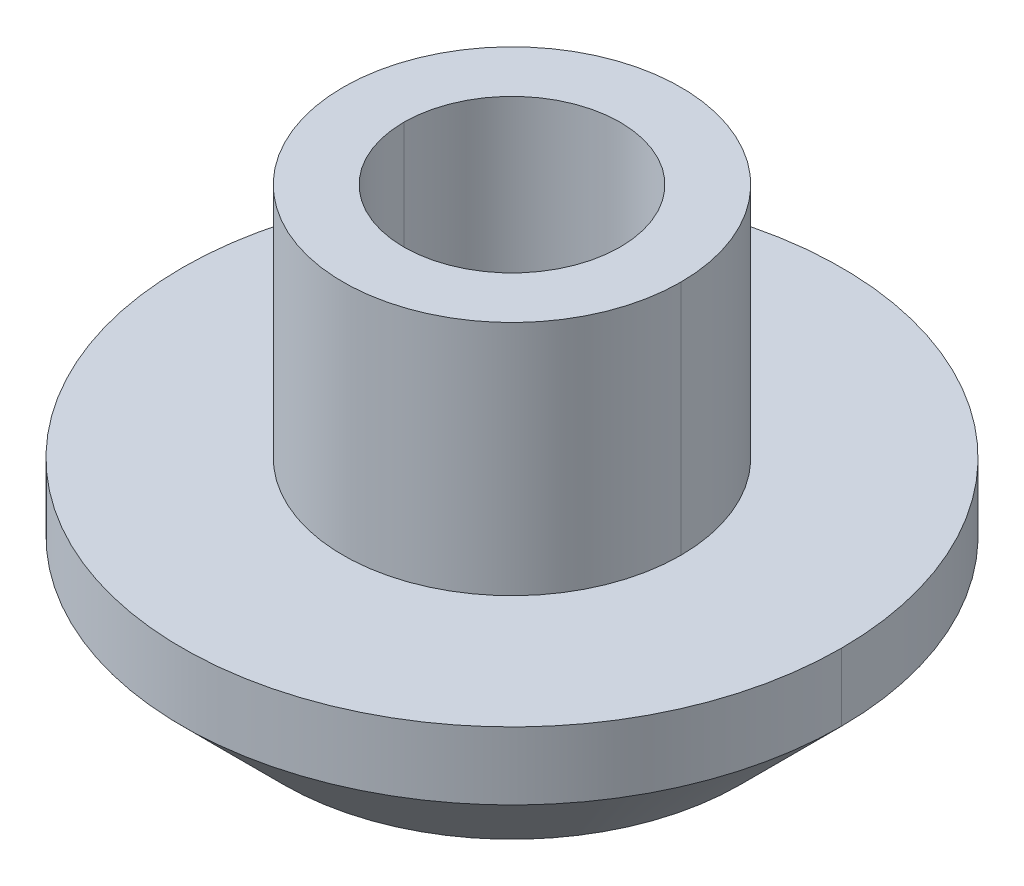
ISO-10303-21;
HEADER;
FILE_DESCRIPTION(('STEP AP214'),'2;1');
FILE_NAME('part.step','',(''),(''),'','','');
FILE_SCHEMA(('AUTOMOTIVE_DESIGN { 1 0 10303 214 1 1 1 1 }'));
ENDSEC;
DATA;
#1=APPLICATION_CONTEXT('core data for automotive mechanical design processes');
#2=APPLICATION_PROTOCOL_DEFINITION('international standard','automotive_design',2000,#1);
#3=PRODUCT_CONTEXT('',#1,'mechanical');
#4=PRODUCT('Part','Part','',(#3));
#5=PRODUCT_RELATED_PRODUCT_CATEGORY('part','',(#4));
#6=PRODUCT_DEFINITION_FORMATION('','',#4);
#7=PRODUCT_DEFINITION_CONTEXT('part definition',#1,'design');
#8=PRODUCT_DEFINITION('design','',#6,#7);
#9=PRODUCT_DEFINITION_SHAPE('','',#8);
#10=(LENGTH_UNIT() NAMED_UNIT(*) SI_UNIT(.MILLI.,.METRE.));
#11=(NAMED_UNIT(*) PLANE_ANGLE_UNIT() SI_UNIT($,.RADIAN.));
#12=(NAMED_UNIT(*) SI_UNIT($,.STERADIAN.) SOLID_ANGLE_UNIT());
#13=UNCERTAINTY_MEASURE_WITH_UNIT(LENGTH_MEASURE(1.E-05),#10,'distance_accuracy_value','');
#14=(GEOMETRIC_REPRESENTATION_CONTEXT(3) GLOBAL_UNCERTAINTY_ASSIGNED_CONTEXT((#13)) GLOBAL_UNIT_ASSIGNED_CONTEXT((#10,
#11,#12)) REPRESENTATION_CONTEXT('',''));
#15=CARTESIAN_POINT('',(0.,0.,0.));
#16=DIRECTION('',(0.,0.,1.));
#17=DIRECTION('',(1.,0.,0.));
#18=AXIS2_PLACEMENT_3D('',#15,#16,#17);
#19=CARTESIAN_POINT('',(0.,-5.,0.));
#20=DIRECTION('',(0.,1.,0.));
#21=DIRECTION('',(1.,0.,0.));
#22=AXIS2_PLACEMENT_3D('',#19,#20,#21);
#23=PLANE('',#22);
#24=CARTESIAN_POINT('',(0.,-5.,0.));
#25=DIRECTION('',(0.,-1.,0.));
#26=DIRECTION('',(1.,0.,0.));
#27=AXIS2_PLACEMENT_3D('',#24,#25,#26);
#28=CIRCLE('',#27,6.5);
#29=CARTESIAN_POINT('',(6.5,-5.,0.));
#30=VERTEX_POINT('',#29);
#31=CARTESIAN_POINT('',(-6.5,-5.,0.));
#32=VERTEX_POINT('',#31);
#33=EDGE_CURVE('E145',#30,#32,#28,.T.);
#34=ORIENTED_EDGE('',*,*,#33,.F.);
#35=CARTESIAN_POINT('',(0.,-5.,0.));
#36=DIRECTION('',(0.,-1.,0.));
#37=DIRECTION('',(-1.,0.,0.));
#38=AXIS2_PLACEMENT_3D('',#35,#36,#37);
#39=CIRCLE('',#38,6.5);
#40=EDGE_CURVE('E156',#32,#30,#39,.T.);
#41=ORIENTED_EDGE('',*,*,#40,.F.);
#42=EDGE_LOOP('',(#34,#41));
#43=FACE_BOUND('',#42,.T.);
#44=CARTESIAN_POINT('',(0.,-5.,0.));
#45=DIRECTION('',(0.,1.,0.));
#46=DIRECTION('',(-1.,0.,0.));
#47=AXIS2_PLACEMENT_3D('',#44,#45,#46);
#48=CIRCLE('',#47,6.75);
#49=CARTESIAN_POINT('',(-6.75,-5.,0.));
#50=VERTEX_POINT('',#49);
#51=CARTESIAN_POINT('',(6.75,-5.,0.));
#52=VERTEX_POINT('',#51);
#53=EDGE_CURVE('E197',#50,#52,#48,.T.);
#54=ORIENTED_EDGE('',*,*,#53,.F.);
#55=CARTESIAN_POINT('',(0.,-5.,0.));
#56=DIRECTION('',(0.,1.,0.));
#57=DIRECTION('',(1.,0.,0.));
#58=AXIS2_PLACEMENT_3D('',#55,#56,#57);
#59=CIRCLE('',#58,6.75);
#60=EDGE_CURVE('E11',#52,#50,#59,.T.);
#61=ORIENTED_EDGE('',*,*,#60,.F.);
#62=EDGE_LOOP('',(#54,#61));
#63=FACE_BOUND('',#62,.T.);
#64=ADVANCED_FACE('F16',(#43,#63),#23,.F.);
#65=CARTESIAN_POINT('',(0.,-3.500000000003,0.));
#66=DIRECTION('',(0.,1.,0.));
#67=DIRECTION('',(0.,0.,-1.));
#68=AXIS2_PLACEMENT_3D('',#65,#66,#67);
#69=CONICAL_SURFACE('',#68,8.249999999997,0.785398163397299);
#70=DIRECTION('',(-0.707106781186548,-0.707106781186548,-1.03309065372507E-12));
#71=VECTOR('',#70,1.);
#72=CARTESIAN_POINT('',(9.749999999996,-2.000000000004,5.697001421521E-11));
#73=LINE('',#72,#71);
#74=CARTESIAN_POINT('',(9.75,-2.,0.));
#75=VERTEX_POINT('',#74);
#76=EDGE_CURVE('E188',#75,#52,#73,.T.);
#77=ORIENTED_EDGE('',*,*,#76,.T.);
#78=ORIENTED_EDGE('',*,*,#60,.T.);
#79=DIRECTION('',(0.707106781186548,-0.707106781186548,1.03262819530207E-12));
#80=VECTOR('',#79,1.);
#81=CARTESIAN_POINT('',(-9.749999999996,-2.000000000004,-5.697273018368E-11));
#82=LINE('',#81,#80);
#83=CARTESIAN_POINT('',(-9.75,-2.,0.));
#84=VERTEX_POINT('',#83);
#85=EDGE_CURVE('E193',#84,#50,#82,.T.);
#86=ORIENTED_EDGE('',*,*,#85,.F.);
#87=CARTESIAN_POINT('',(0.,-2.,0.));
#88=DIRECTION('',(0.,1.,0.));
#89=DIRECTION('',(1.,0.,0.));
#90=AXIS2_PLACEMENT_3D('',#87,#88,#89);
#91=CIRCLE('',#90,9.75);
#92=EDGE_CURVE('E26',#75,#84,#91,.T.);
#93=ORIENTED_EDGE('',*,*,#92,.F.);
#94=EDGE_LOOP('',(#77,#78,#86,#93));
#95=FACE_BOUND('',#94,.T.);
#96=ADVANCED_FACE('F18',(#95),#69,.T.);
#97=CARTESIAN_POINT('',(0.,-5.6,0.));
#98=DIRECTION('',(0.,1.,0.));
#99=DIRECTION('',(1.,0.,0.));
#100=AXIS2_PLACEMENT_3D('',#97,#98,#99);
#101=CYLINDRICAL_SURFACE('',#100,9.75);
#102=DIRECTION('',(-2.160938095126E-12,1.,2.848564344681E-11));
#103=VECTOR('',#102,1.);
#104=CARTESIAN_POINT('',(-9.749999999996,-2.000000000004,-5.697273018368E-11));
#105=LINE('',#104,#103);
#106=CARTESIAN_POINT('',(-9.75,0.,0.));
#107=VERTEX_POINT('',#106);
#108=EDGE_CURVE('E75',#84,#107,#105,.T.);
#109=ORIENTED_EDGE('',*,*,#108,.T.);
#110=CARTESIAN_POINT('',(0.,0.,0.));
#111=DIRECTION('',(0.,1.,0.));
#112=DIRECTION('',(1.,0.,0.));
#113=AXIS2_PLACEMENT_3D('',#110,#111,#112);
#114=CIRCLE('',#113,9.75);
#115=CARTESIAN_POINT('',(9.75,0.,0.));
#116=VERTEX_POINT('',#115);
#117=EDGE_CURVE('E173',#116,#107,#114,.T.);
#118=ORIENTED_EDGE('',*,*,#117,.F.);
#119=DIRECTION('',(2.160938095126E-12,1.,-2.848500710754E-11));
#120=VECTOR('',#119,1.);
#121=CARTESIAN_POINT('',(9.749999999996,-2.000000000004,5.697001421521E-11));
#122=LINE('',#121,#120);
#123=EDGE_CURVE('E65',#75,#116,#122,.T.);
#124=ORIENTED_EDGE('',*,*,#123,.F.);
#125=ORIENTED_EDGE('',*,*,#92,.T.);
#126=EDGE_LOOP('',(#109,#118,#124,#125));
#127=FACE_BOUND('',#126,.T.);
#128=ADVANCED_FACE('F330',(#127),#101,.T.);
#129=CARTESIAN_POINT('',(0.,-5.6,0.));
#130=DIRECTION('',(0.,1.,0.));
#131=DIRECTION('',(1.,0.,0.));
#132=AXIS2_PLACEMENT_3D('',#129,#130,#131);
#133=CYLINDRICAL_SURFACE('',#132,9.75);
#134=ORIENTED_EDGE('',*,*,#123,.T.);
#135=CARTESIAN_POINT('',(0.,0.,0.));
#136=DIRECTION('',(0.,-1.,0.));
#137=DIRECTION('',(1.,0.,0.));
#138=AXIS2_PLACEMENT_3D('',#135,#136,#137);
#139=CIRCLE('',#138,9.75);
#140=EDGE_CURVE('E198',#116,#107,#139,.T.);
#141=ORIENTED_EDGE('',*,*,#140,.T.);
#142=ORIENTED_EDGE('',*,*,#108,.F.);
#143=CARTESIAN_POINT('',(0.,-2.,0.));
#144=DIRECTION('',(0.,1.,0.));
#145=DIRECTION('',(-1.,0.,0.));
#146=AXIS2_PLACEMENT_3D('',#143,#144,#145);
#147=CIRCLE('',#146,9.75);
#148=EDGE_CURVE('E185',#84,#75,#147,.T.);
#149=ORIENTED_EDGE('',*,*,#148,.T.);
#150=EDGE_LOOP('',(#134,#141,#142,#149));
#151=FACE_BOUND('',#150,.T.);
#152=ADVANCED_FACE('F334',(#151),#133,.T.);
#153=CARTESIAN_POINT('',(0.,-3.500000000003,0.));
#154=DIRECTION('',(0.,1.,0.));
#155=DIRECTION('',(0.,0.,-1.));
#156=AXIS2_PLACEMENT_3D('',#153,#154,#155);
#157=CONICAL_SURFACE('',#156,8.249999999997,0.785398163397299);
#158=ORIENTED_EDGE('',*,*,#85,.T.);
#159=ORIENTED_EDGE('',*,*,#53,.T.);
#160=ORIENTED_EDGE('',*,*,#76,.F.);
#161=ORIENTED_EDGE('',*,*,#148,.F.);
#162=EDGE_LOOP('',(#158,#159,#160,#161));
#163=FACE_BOUND('',#162,.T.);
#164=ADVANCED_FACE('F312',(#163),#157,.T.);
#165=CARTESIAN_POINT('',(0.,0.,0.));
#166=DIRECTION('',(0.,1.,0.));
#167=DIRECTION('',(1.,0.,0.));
#168=AXIS2_PLACEMENT_3D('',#165,#166,#167);
#169=PLANE('',#168);
#170=CARTESIAN_POINT('',(0.,0.,0.));
#171=DIRECTION('',(0.,-1.,0.));
#172=DIRECTION('',(1.,0.,0.));
#173=AXIS2_PLACEMENT_3D('',#170,#171,#172);
#174=CIRCLE('',#173,4.995);
#175=CARTESIAN_POINT('',(4.995,0.,0.));
#176=VERTEX_POINT('',#175);
#177=CARTESIAN_POINT('',(-4.995,0.,0.));
#178=VERTEX_POINT('',#177);
#179=EDGE_CURVE('E181',#176,#178,#174,.T.);
#180=ORIENTED_EDGE('',*,*,#179,.T.);
#181=CARTESIAN_POINT('',(0.,0.,0.));
#182=DIRECTION('',(0.,1.,0.));
#183=DIRECTION('',(1.,0.,0.));
#184=AXIS2_PLACEMENT_3D('',#181,#182,#183);
#185=CIRCLE('',#184,4.995);
#186=EDGE_CURVE('E172',#176,#178,#185,.T.);
#187=ORIENTED_EDGE('',*,*,#186,.F.);
#188=EDGE_LOOP('',(#180,#187));
#189=FACE_BOUND('',#188,.T.);
#190=ORIENTED_EDGE('',*,*,#117,.T.);
#191=ORIENTED_EDGE('',*,*,#140,.F.);
#192=EDGE_LOOP('',(#190,#191));
#193=FACE_BOUND('',#192,.T.);
#194=ADVANCED_FACE('F302',(#189,#193),#169,.T.);
#195=CARTESIAN_POINT('',(0.,-5.6,0.));
#196=DIRECTION('',(0.,1.,0.));
#197=DIRECTION('',(1.,0.,0.));
#198=AXIS2_PLACEMENT_3D('',#195,#196,#197);
#199=CYLINDRICAL_SURFACE('',#198,4.995);
#200=ORIENTED_EDGE('',*,*,#186,.T.);
#201=DIRECTION('',(0.,1.,0.));
#202=VECTOR('',#201,1.);
#203=CARTESIAN_POINT('',(-4.995,0.,0.));
#204=LINE('',#203,#202);
#205=CARTESIAN_POINT('',(-4.995,7.,0.));
#206=VERTEX_POINT('',#205);
#207=EDGE_CURVE('E121',#178,#206,#204,.T.);
#208=ORIENTED_EDGE('',*,*,#207,.T.);
#209=CARTESIAN_POINT('',(0.,7.,0.));
#210=DIRECTION('',(0.,1.,0.));
#211=DIRECTION('',(1.,0.,0.));
#212=AXIS2_PLACEMENT_3D('',#209,#210,#211);
#213=CIRCLE('',#212,4.995);
#214=CARTESIAN_POINT('',(4.995,7.,0.));
#215=VERTEX_POINT('',#214);
#216=EDGE_CURVE('E201',#215,#206,#213,.T.);
#217=ORIENTED_EDGE('',*,*,#216,.F.);
#218=DIRECTION('',(0.,1.,0.));
#219=VECTOR('',#218,1.);
#220=CARTESIAN_POINT('',(4.995,0.,0.));
#221=LINE('',#220,#219);
#222=EDGE_CURVE('E111',#176,#215,#221,.T.);
#223=ORIENTED_EDGE('',*,*,#222,.F.);
#224=EDGE_LOOP('',(#200,#208,#217,#223));
#225=FACE_BOUND('',#224,.T.);
#226=ADVANCED_FACE('F292',(#225),#199,.T.);
#227=CARTESIAN_POINT('',(0.,-5.6,0.));
#228=DIRECTION('',(0.,1.,0.));
#229=DIRECTION('',(1.,0.,0.));
#230=AXIS2_PLACEMENT_3D('',#227,#228,#229);
#231=CYLINDRICAL_SURFACE('',#230,4.995);
#232=CARTESIAN_POINT('',(0.,7.,0.));
#233=DIRECTION('',(0.,-1.,0.));
#234=DIRECTION('',(1.,0.,0.));
#235=AXIS2_PLACEMENT_3D('',#232,#233,#234);
#236=CIRCLE('',#235,4.995);
#237=EDGE_CURVE('E182',#215,#206,#236,.T.);
#238=ORIENTED_EDGE('',*,*,#237,.T.);
#239=ORIENTED_EDGE('',*,*,#207,.F.);
#240=ORIENTED_EDGE('',*,*,#179,.F.);
#241=ORIENTED_EDGE('',*,*,#222,.T.);
#242=EDGE_LOOP('',(#238,#239,#240,#241));
#243=FACE_BOUND('',#242,.T.);
#244=ADVANCED_FACE('F281',(#243),#231,.T.);
#245=CARTESIAN_POINT('',(0.,7.,0.));
#246=DIRECTION('',(0.,1.,0.));
#247=DIRECTION('',(1.,0.,0.));
#248=AXIS2_PLACEMENT_3D('',#245,#246,#247);
#249=PLANE('',#248);
#250=CARTESIAN_POINT('',(0.,7.,0.));
#251=DIRECTION('',(0.,-1.,0.));
#252=DIRECTION('',(1.,0.,0.));
#253=AXIS2_PLACEMENT_3D('',#250,#251,#252);
#254=CIRCLE('',#253,3.2);
#255=CARTESIAN_POINT('',(3.2,7.,0.));
#256=VERTEX_POINT('',#255);
#257=CARTESIAN_POINT('',(-3.2,7.,0.));
#258=VERTEX_POINT('',#257);
#259=EDGE_CURVE('E141',#256,#258,#254,.T.);
#260=ORIENTED_EDGE('',*,*,#259,.T.);
#261=CARTESIAN_POINT('',(0.,7.,0.));
#262=DIRECTION('',(0.,-1.,0.));
#263=DIRECTION('',(-1.,0.,0.));
#264=AXIS2_PLACEMENT_3D('',#261,#262,#263);
#265=CIRCLE('',#264,3.2);
#266=EDGE_CURVE('E102',#258,#256,#265,.T.);
#267=ORIENTED_EDGE('',*,*,#266,.T.);
#268=EDGE_LOOP('',(#260,#267));
#269=FACE_BOUND('',#268,.T.);
#270=ORIENTED_EDGE('',*,*,#216,.T.);
#271=ORIENTED_EDGE('',*,*,#237,.F.);
#272=EDGE_LOOP('',(#270,#271));
#273=FACE_BOUND('',#272,.T.);
#274=ADVANCED_FACE('F271',(#269,#273),#249,.T.);
#275=CARTESIAN_POINT('',(0.,8.860000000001,0.));
#276=DIRECTION('',(0.,-1.,0.));
#277=DIRECTION('',(-1.,0.,0.));
#278=AXIS2_PLACEMENT_3D('',#275,#276,#277);
#279=CYLINDRICAL_SURFACE('',#278,3.2);
#280=DIRECTION('',(0.,-1.,0.));
#281=VECTOR('',#280,1.);
#282=CARTESIAN_POINT('',(-3.2,7.,0.));
#283=LINE('',#282,#281);
#284=CARTESIAN_POINT('',(-3.2,-1.7,0.));
#285=VERTEX_POINT('',#284);
#286=EDGE_CURVE('E144',#258,#285,#283,.T.);
#287=ORIENTED_EDGE('',*,*,#286,.T.);
#288=CARTESIAN_POINT('',(0.,-1.7,0.));
#289=DIRECTION('',(0.,-1.,0.));
#290=DIRECTION('',(-1.,0.,0.));
#291=AXIS2_PLACEMENT_3D('',#288,#289,#290);
#292=CIRCLE('',#291,3.2);
#293=CARTESIAN_POINT('',(3.2,-1.7,0.));
#294=VERTEX_POINT('',#293);
#295=EDGE_CURVE('E158',#285,#294,#292,.T.);
#296=ORIENTED_EDGE('',*,*,#295,.T.);
#297=DIRECTION('',(0.,-1.,0.));
#298=VECTOR('',#297,1.);
#299=CARTESIAN_POINT('',(3.2,7.,0.));
#300=LINE('',#299,#298);
#301=EDGE_CURVE('E135',#256,#294,#300,.T.);
#302=ORIENTED_EDGE('',*,*,#301,.F.);
#303=ORIENTED_EDGE('',*,*,#266,.F.);
#304=EDGE_LOOP('',(#287,#296,#302,#303));
#305=FACE_BOUND('',#304,.T.);
#306=ADVANCED_FACE('F159',(#305),#279,.F.);
#307=CARTESIAN_POINT('',(0.,8.860000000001,0.));
#308=DIRECTION('',(0.,-1.,0.));
#309=DIRECTION('',(-1.,0.,0.));
#310=AXIS2_PLACEMENT_3D('',#307,#308,#309);
#311=CYLINDRICAL_SURFACE('',#310,3.2);
#312=ORIENTED_EDGE('',*,*,#301,.T.);
#313=CARTESIAN_POINT('',(0.,-1.7,0.));
#314=DIRECTION('',(0.,1.,0.));
#315=DIRECTION('',(-1.,0.,0.));
#316=AXIS2_PLACEMENT_3D('',#313,#314,#315);
#317=CIRCLE('',#316,3.2);
#318=EDGE_CURVE('E139',#285,#294,#317,.T.);
#319=ORIENTED_EDGE('',*,*,#318,.F.);
#320=ORIENTED_EDGE('',*,*,#286,.F.);
#321=ORIENTED_EDGE('',*,*,#259,.F.);
#322=EDGE_LOOP('',(#312,#319,#320,#321));
#323=FACE_BOUND('',#322,.T.);
#324=ADVANCED_FACE('F137',(#323),#311,.F.);
#325=CARTESIAN_POINT('',(0.,-3.35,0.));
#326=DIRECTION('',(0.,-1.,0.));
#327=DIRECTION('',(-1.,0.,0.));
#328=AXIS2_PLACEMENT_3D('',#325,#326,#327);
#329=CONICAL_SURFACE('',#328,4.85,0.785398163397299);
#330=DIRECTION('',(-0.707106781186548,-0.707106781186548,0.));
#331=VECTOR('',#330,1.);
#332=CARTESIAN_POINT('',(-3.2,-1.7,0.));
#333=LINE('',#332,#331);
#334=EDGE_CURVE('E153',#285,#32,#333,.T.);
#335=ORIENTED_EDGE('',*,*,#334,.F.);
#336=ORIENTED_EDGE('',*,*,#318,.T.);
#337=DIRECTION('',(0.707106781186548,-0.707106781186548,0.));
#338=VECTOR('',#337,1.);
#339=CARTESIAN_POINT('',(3.2,-1.7,0.));
#340=LINE('',#339,#338);
#341=EDGE_CURVE('E151',#294,#30,#340,.T.);
#342=ORIENTED_EDGE('',*,*,#341,.T.);
#343=ORIENTED_EDGE('',*,*,#33,.T.);
#344=EDGE_LOOP('',(#335,#336,#342,#343));
#345=FACE_BOUND('',#344,.T.);
#346=ADVANCED_FACE('F149',(#345),#329,.F.);
#347=CARTESIAN_POINT('',(0.,-3.35,0.));
#348=DIRECTION('',(0.,-1.,0.));
#349=DIRECTION('',(-1.,0.,0.));
#350=AXIS2_PLACEMENT_3D('',#347,#348,#349);
#351=CONICAL_SURFACE('',#350,4.85,0.785398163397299);
#352=ORIENTED_EDGE('',*,*,#341,.F.);
#353=ORIENTED_EDGE('',*,*,#295,.F.);
#354=ORIENTED_EDGE('',*,*,#334,.T.);
#355=ORIENTED_EDGE('',*,*,#40,.T.);
#356=EDGE_LOOP('',(#352,#353,#354,#355));
#357=FACE_BOUND('',#356,.T.);
#358=ADVANCED_FACE('F164',(#357),#351,.F.);
#359=CLOSED_SHELL('',(#64,#96,#128,#152,#164,#194,#226,#244,#274,#306,#324,#346,#358));
#360=MANIFOLD_SOLID_BREP('B1',#359);
#361=ADVANCED_BREP_SHAPE_REPRESENTATION('',(#18,#360),#14);
#362=SHAPE_DEFINITION_REPRESENTATION(#9,#361);
ENDSEC;
END-ISO-10303-21;
